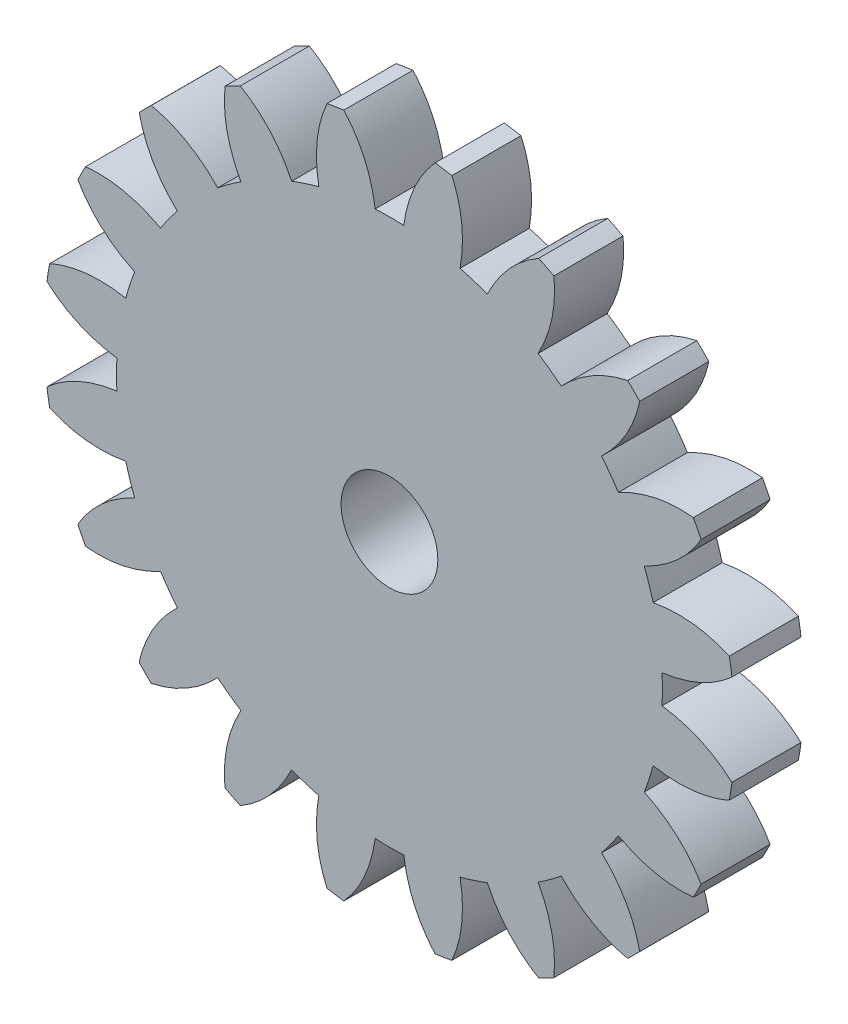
from build123d import *

# Parameters (mm, degrees)
SKETCH_3_R      = 7
EXTRUDE_1_DEPTH = 5


with BuildPart() as part:
    # Sketch 3 → Extrude 1 (new, symmetric)
    with BuildSketch(Plane.XY):
        with BuildLine():
            ThreePointArc((2.067270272, 39.445866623), (0, 39.5), (-2.067270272, 39.445866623))
            add(Edge.make_bspline(
                [(-2.067270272, 39.445866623), (-2.884023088, 45.427492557), (-6.604591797, 49.561874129)],
                knots=[0, 0, 0, 1, 1, 1], degree=2))
            ThreePointArc((-6.604591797, 49.561874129), (-7.821723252, 49.38441703), (-9.034121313, 49.177074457))
            add(Edge.make_bspline(
                [(-10.223352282, 38.154070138), (-11.294998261, 44.095324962), (-9.034121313, 49.177074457)],
                knots=[0, 0, 0, 1, 1, 1], degree=2))
            ThreePointArc((-10.223352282, 38.154070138), (-12.206171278, 37.566732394), (-14.155534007, 36.876426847))
            add(Edge.make_bspline(
                [(-14.155534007, 36.876426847), (-16.780736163, 42.312900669), (-21.596801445, 45.095212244)],
                knots=[0, 0, 0, 1, 1, 1], degree=2))
            ThreePointArc((-21.596801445, 45.095212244), (-22.699524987, 44.550326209), (-23.788511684, 43.978480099))
            add(Edge.make_bspline(
                [(-21.513241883, 33.127487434), (-24.368386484, 38.446799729), (-23.788511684, 43.978480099)],
                knots=[0, 0, 0, 1, 1, 1], degree=2))
            ThreePointArc((-21.513241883, 33.127487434), (-23.217517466, 31.956171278), (-24.858155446, 30.697265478))
            add(Edge.make_bspline(
                [(-24.858155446, 30.697265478), (-29.034833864, 35.056427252), (-34.474965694, 36.214316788)],
                knots=[0, 0, 0, 1, 1, 1], degree=2))
            ThreePointArc((-34.474965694, 36.214316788), (-35.355339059, 35.355339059), (-36.214316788, 34.474965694))
            add(Edge.make_bspline(
                [(-30.697265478, 24.858155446), (-35.056427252, 29.034833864), (-36.214316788, 34.474965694)],
                knots=[0, 0, 0, 1, 1, 1], degree=2))
            ThreePointArc((-30.697265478, 24.858155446), (-31.956171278, 23.217517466), (-33.127487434, 21.513241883))
            add(Edge.make_bspline(
                [(-33.127487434, 21.513241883), (-38.446799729, 24.368386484), (-43.978480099, 23.788511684)],
                knots=[0, 0, 0, 1, 1, 1], degree=2))
            ThreePointArc((-43.978480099, 23.788511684), (-44.550326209, 22.699524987), (-45.095212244, 21.596801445))
            add(Edge.make_bspline(
                [(-36.876426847, 14.155534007), (-42.312900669, 16.780736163), (-45.095212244, 21.596801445)],
                knots=[0, 0, 0, 1, 1, 1], degree=2))
            ThreePointArc((-36.876426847, 14.155534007), (-37.566732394, 12.206171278), (-38.154070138, 10.223352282))
            add(Edge.make_bspline(
                [(-38.154070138, 10.223352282), (-44.095324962, 11.294998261), (-49.177074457, 9.034121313)],
                knots=[0, 0, 0, 1, 1, 1], degree=2))
            ThreePointArc((-49.177074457, 9.034121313), (-49.38441703, 7.821723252), (-49.561874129, 6.604591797))
            add(Edge.make_bspline(
                [(-39.445866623, 2.067270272), (-45.427492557, 2.884023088), (-49.561874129, 6.604591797)],
                knots=[0, 0, 0, 1, 1, 1], degree=2))
            ThreePointArc((-39.445866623, 2.067270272), (-39.5, 0), (-39.445866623, -2.067270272))
            add(Edge.make_bspline(
                [(-39.445866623, -2.067270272), (-45.427492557, -2.884023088), (-49.561874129, -6.604591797)],
                knots=[0, 0, 0, 1, 1, 1], degree=2))
            ThreePointArc((-49.561874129, -6.604591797), (-49.38441703, -7.821723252), (-49.177074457, -9.034121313))
            add(Edge.make_bspline(
                [(-38.154070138, -10.223352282), (-44.095324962, -11.294998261), (-49.177074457, -9.034121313)],
                knots=[0, 0, 0, 1, 1, 1], degree=2))
            ThreePointArc((-38.154070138, -10.223352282), (-37.566732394, -12.206171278), (-36.876426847, -14.155534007))
            add(Edge.make_bspline(
                [(-36.876426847, -14.155534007), (-42.312900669, -16.780736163), (-45.095212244, -21.596801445)],
                knots=[0, 0, 0, 1, 1, 1], degree=2))
            ThreePointArc((-45.095212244, -21.596801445), (-44.550326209, -22.699524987), (-43.978480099, -23.788511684))
            add(Edge.make_bspline(
                [(-33.127487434, -21.513241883), (-38.446799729, -24.368386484), (-43.978480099, -23.788511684)],
                knots=[0, 0, 0, 1, 1, 1], degree=2))
            ThreePointArc((-33.127487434, -21.513241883), (-31.956171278, -23.217517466), (-30.697265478, -24.858155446))
            add(Edge.make_bspline(
                [(-30.697265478, -24.858155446), (-35.056427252, -29.034833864), (-36.214316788, -34.474965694)],
                knots=[0, 0, 0, 1, 1, 1], degree=2))
            ThreePointArc((-36.214316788, -34.474965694), (-35.355339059, -35.355339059), (-34.474965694, -36.214316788))
            add(Edge.make_bspline(
                [(-24.858155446, -30.697265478), (-29.034833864, -35.056427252), (-34.474965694, -36.214316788)],
                knots=[0, 0, 0, 1, 1, 1], degree=2))
            ThreePointArc((-24.858155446, -30.697265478), (-23.217517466, -31.956171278), (-21.513241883, -33.127487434))
            add(Edge.make_bspline(
                [(-21.513241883, -33.127487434), (-24.368386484, -38.446799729), (-23.788511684, -43.978480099)],
                knots=[0, 0, 0, 1, 1, 1], degree=2))
            ThreePointArc((-23.788511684, -43.978480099), (-22.699524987, -44.550326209), (-21.596801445, -45.095212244))
            add(Edge.make_bspline(
                [(-14.155534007, -36.876426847), (-16.780736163, -42.312900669), (-21.596801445, -45.095212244)],
                knots=[0, 0, 0, 1, 1, 1], degree=2))
            ThreePointArc((-14.155534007, -36.876426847), (-12.206171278, -37.566732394), (-10.223352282, -38.154070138))
            add(Edge.make_bspline(
                [(-10.223352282, -38.154070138), (-11.294998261, -44.095324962), (-9.034121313, -49.177074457)],
                knots=[0, 0, 0, 1, 1, 1], degree=2))
            ThreePointArc((-9.034121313, -49.177074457), (-7.821723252, -49.38441703), (-6.604591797, -49.561874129))
            add(Edge.make_bspline(
                [(-2.067270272, -39.445866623), (-2.884023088, -45.427492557), (-6.604591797, -49.561874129)],
                knots=[0, 0, 0, 1, 1, 1], degree=2))
            ThreePointArc((-2.067270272, -39.445866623), (0, -39.5), (2.067270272, -39.445866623))
            add(Edge.make_bspline(
                [(2.067270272, -39.445866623), (2.884023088, -45.427492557), (6.604591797, -49.561874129)],
                knots=[0, 0, 0, 1, 1, 1], degree=2))
            ThreePointArc((6.604591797, -49.561874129), (7.821723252, -49.38441703), (9.034121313, -49.177074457))
            add(Edge.make_bspline(
                [(10.223352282, -38.154070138), (11.294998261, -44.095324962), (9.034121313, -49.177074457)],
                knots=[0, 0, 0, 1, 1, 1], degree=2))
            ThreePointArc((10.223352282, -38.154070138), (12.206171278, -37.566732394), (14.155534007, -36.876426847))
            add(Edge.make_bspline(
                [(14.155534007, -36.876426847), (16.780736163, -42.312900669), (21.596801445, -45.095212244)],
                knots=[0, 0, 0, 1, 1, 1], degree=2))
            ThreePointArc((21.596801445, -45.095212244), (22.699524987, -44.550326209), (23.788511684, -43.978480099))
            add(Edge.make_bspline(
                [(21.513241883, -33.127487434), (24.368386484, -38.446799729), (23.788511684, -43.978480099)],
                knots=[0, 0, 0, 1, 1, 1], degree=2))
            ThreePointArc((21.513241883, -33.127487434), (23.217517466, -31.956171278), (24.858155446, -30.697265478))
            add(Edge.make_bspline(
                [(24.858155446, -30.697265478), (29.034833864, -35.056427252), (34.474965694, -36.214316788)],
                knots=[0, 0, 0, 1, 1, 1], degree=2))
            ThreePointArc((34.474965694, -36.214316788), (35.355339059, -35.355339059), (36.214316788, -34.474965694))
            add(Edge.make_bspline(
                [(30.697265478, -24.858155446), (35.056427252, -29.034833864), (36.214316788, -34.474965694)],
                knots=[0, 0, 0, 1, 1, 1], degree=2))
            ThreePointArc((30.697265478, -24.858155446), (31.956171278, -23.217517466), (33.127487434, -21.513241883))
            add(Edge.make_bspline(
                [(33.127487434, -21.513241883), (38.446799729, -24.368386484), (43.978480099, -23.788511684)],
                knots=[0, 0, 0, 1, 1, 1], degree=2))
            ThreePointArc((43.978480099, -23.788511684), (44.550326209, -22.699524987), (45.095212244, -21.596801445))
            add(Edge.make_bspline(
                [(36.876426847, -14.155534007), (42.312900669, -16.780736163), (45.095212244, -21.596801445)],
                knots=[0, 0, 0, 1, 1, 1], degree=2))
            ThreePointArc((36.876426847, -14.155534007), (37.566732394, -12.206171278), (38.154070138, -10.223352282))
            add(Edge.make_bspline(
                [(38.154070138, -10.223352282), (44.095324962, -11.294998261), (49.177074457, -9.034121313)],
                knots=[0, 0, 0, 1, 1, 1], degree=2))
            ThreePointArc((49.177074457, -9.034121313), (49.38441703, -7.821723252), (49.561874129, -6.604591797))
            add(Edge.make_bspline(
                [(39.445866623, -2.067270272), (45.427492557, -2.884023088), (49.561874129, -6.604591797)],
                knots=[0, 0, 0, 1, 1, 1], degree=2))
            ThreePointArc((39.445866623, -2.067270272), (39.5, 0), (39.445866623, 2.067270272))
            add(Edge.make_bspline(
                [(39.445866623, 2.067270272), (45.427492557, 2.884023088), (49.561874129, 6.604591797)],
                knots=[0, 0, 0, 1, 1, 1], degree=2))
            ThreePointArc((49.561874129, 6.604591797), (49.38441703, 7.821723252), (49.177074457, 9.034121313))
            add(Edge.make_bspline(
                [(38.154070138, 10.223352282), (44.095324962, 11.294998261), (49.177074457, 9.034121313)],
                knots=[0, 0, 0, 1, 1, 1], degree=2))
            ThreePointArc((38.154070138, 10.223352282), (37.566732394, 12.206171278), (36.876426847, 14.155534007))
            add(Edge.make_bspline(
                [(36.876426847, 14.155534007), (42.312900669, 16.780736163), (45.095212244, 21.596801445)],
                knots=[0, 0, 0, 1, 1, 1], degree=2))
            ThreePointArc((45.095212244, 21.596801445), (44.550326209, 22.699524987), (43.978480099, 23.788511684))
            add(Edge.make_bspline(
                [(33.127487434, 21.513241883), (38.446799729, 24.368386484), (43.978480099, 23.788511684)],
                knots=[0, 0, 0, 1, 1, 1], degree=2))
            ThreePointArc((33.127487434, 21.513241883), (31.956171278, 23.217517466), (30.697265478, 24.858155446))
            add(Edge.make_bspline(
                [(30.697265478, 24.858155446), (35.056427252, 29.034833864), (36.214316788, 34.474965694)],
                knots=[0, 0, 0, 1, 1, 1], degree=2))
            ThreePointArc((36.214316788, 34.474965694), (35.355339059, 35.355339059), (34.474965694, 36.214316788))
            add(Edge.make_bspline(
                [(24.858155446, 30.697265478), (29.034833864, 35.056427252), (34.474965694, 36.214316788)],
                knots=[0, 0, 0, 1, 1, 1], degree=2))
            ThreePointArc((24.858155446, 30.697265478), (23.217517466, 31.956171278), (21.513241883, 33.127487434))
            add(Edge.make_bspline(
                [(21.513241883, 33.127487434), (24.368386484, 38.446799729), (23.788511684, 43.978480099)],
                knots=[0, 0, 0, 1, 1, 1], degree=2))
            ThreePointArc((23.788511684, 43.978480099), (22.699524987, 44.550326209), (21.596801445, 45.095212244))
            add(Edge.make_bspline(
                [(14.155534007, 36.876426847), (16.780736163, 42.312900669), (21.596801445, 45.095212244)],
                knots=[0, 0, 0, 1, 1, 1], degree=2))
            ThreePointArc((14.155534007, 36.876426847), (12.206171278, 37.566732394), (10.223352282, 38.154070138))
            add(Edge.make_bspline(
                [(10.223352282, 38.154070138), (11.294998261, 44.095324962), (9.034121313, 49.177074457)],
                knots=[0, 0, 0, 1, 1, 1], degree=2))
            ThreePointArc((9.034121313, 49.177074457), (7.821723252, 49.38441703), (6.604591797, 49.561874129))
            add(Edge.make_bspline(
                [(2.067270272, 39.445866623), (2.884023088, 45.427492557), (6.604591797, 49.561874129)],
                knots=[0, 0, 0, 1, 1, 1], degree=2))
        make_face()
        Circle(SKETCH_3_R, mode=Mode.SUBTRACT)
    extrude(amount=EXTRUDE_1_DEPTH, both=True)


solid = part.part
